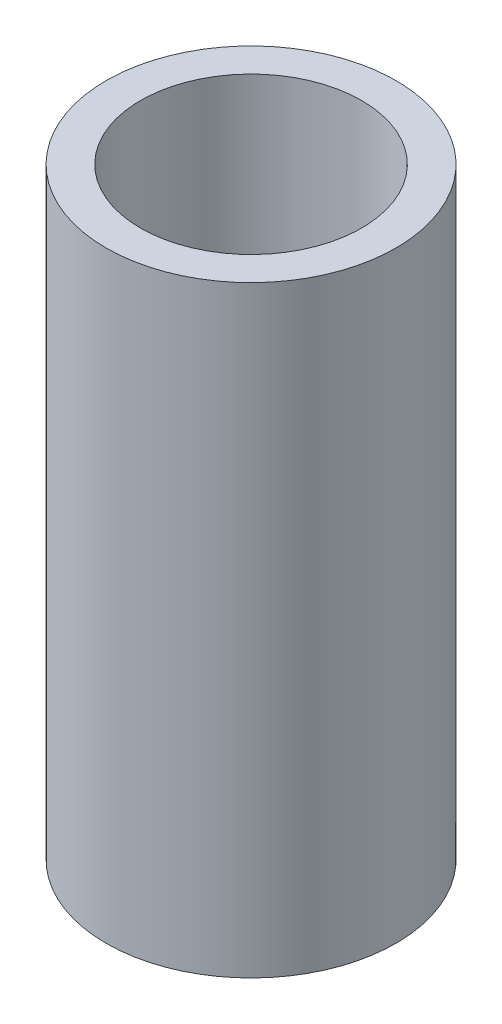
from build123d import *

# Parameters (mm, degrees)
ESQUISSE1_W = 4
ESQUISSE1_H = 70


with BuildPart() as part:
    # Esquisse1 → R_volution1 (revolve)
    with BuildSketch(Plane.XY, mode=Mode.PRIVATE) as r_volution1_sk:
        with Locations((-726.735302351, 1279)):
            Rectangle(ESQUISSE1_W, ESQUISSE1_H)
    revolve(r_volution1_sk.sketch.rotate(Axis((-711.885302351, 1394.639519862, 0), (0, -1, 0)), 270), axis=Axis((-711.885302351, 1394.639519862, 0), (0, -1, 0)))


solid = part.part
